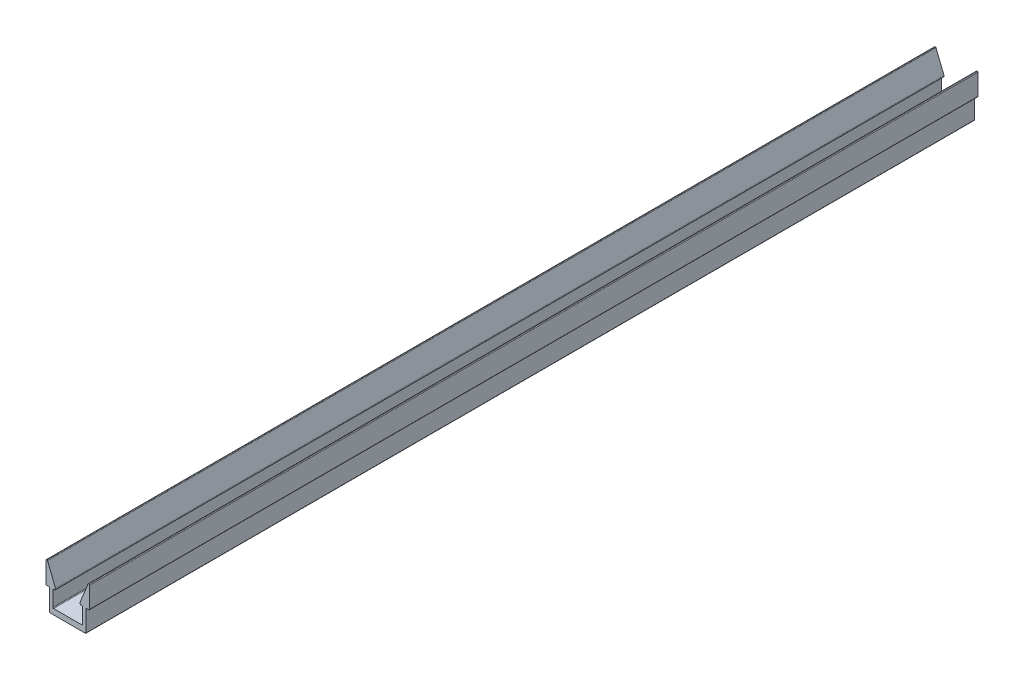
ISO-10303-21;
HEADER;
FILE_DESCRIPTION(('STEP AP214'),'2;1');
FILE_NAME('part.step','',(''),(''),'','','');
FILE_SCHEMA(('AUTOMOTIVE_DESIGN { 1 0 10303 214 1 1 1 1 }'));
ENDSEC;
DATA;
#1=APPLICATION_CONTEXT('core data for automotive mechanical design processes');
#2=APPLICATION_PROTOCOL_DEFINITION('international standard','automotive_design',2000,#1);
#3=PRODUCT_CONTEXT('',#1,'mechanical');
#4=PRODUCT('Part','Part','',(#3));
#5=PRODUCT_RELATED_PRODUCT_CATEGORY('part','',(#4));
#6=PRODUCT_DEFINITION_FORMATION('','',#4);
#7=PRODUCT_DEFINITION_CONTEXT('part definition',#1,'design');
#8=PRODUCT_DEFINITION('design','',#6,#7);
#9=PRODUCT_DEFINITION_SHAPE('','',#8);
#10=(LENGTH_UNIT() NAMED_UNIT(*) SI_UNIT(.MILLI.,.METRE.));
#11=(NAMED_UNIT(*) PLANE_ANGLE_UNIT() SI_UNIT($,.RADIAN.));
#12=(NAMED_UNIT(*) SI_UNIT($,.STERADIAN.) SOLID_ANGLE_UNIT());
#13=UNCERTAINTY_MEASURE_WITH_UNIT(LENGTH_MEASURE(1.E-05),#10,'distance_accuracy_value','');
#14=(GEOMETRIC_REPRESENTATION_CONTEXT(3) GLOBAL_UNCERTAINTY_ASSIGNED_CONTEXT((#13)) GLOBAL_UNIT_ASSIGNED_CONTEXT((#10,
#11,#12)) REPRESENTATION_CONTEXT('',''));
#15=CARTESIAN_POINT('',(0.,0.,0.));
#16=DIRECTION('',(0.,0.,1.));
#17=DIRECTION('',(1.,0.,0.));
#18=AXIS2_PLACEMENT_3D('',#15,#16,#17);
#19=CARTESIAN_POINT('',(8.128,3.175,31.75));
#20=DIRECTION('',(0.,-1.,0.));
#21=DIRECTION('',(0.,0.,-1.));
#22=AXIS2_PLACEMENT_3D('',#19,#20,#21);
#23=PLANE('',#22);
#24=DIRECTION('',(-1.,0.,0.));
#25=VECTOR('',#24,1.);
#26=CARTESIAN_POINT('',(8.128,3.175,0.));
#27=LINE('',#26,#25);
#28=CARTESIAN_POINT('',(8.128,3.175,0.));
#29=VERTEX_POINT('',#28);
#30=CARTESIAN_POINT('',(-8.128,3.175,0.));
#31=VERTEX_POINT('',#30);
#32=EDGE_CURVE('E317',#29,#31,#27,.T.);
#33=ORIENTED_EDGE('',*,*,#32,.T.);
#34=DIRECTION('',(0.,0.,-1.));
#35=VECTOR('',#34,1.);
#36=CARTESIAN_POINT('',(-8.128,3.175,31.75));
#37=LINE('',#36,#35);
#38=CARTESIAN_POINT('',(-8.128,3.175,508.));
#39=VERTEX_POINT('',#38);
#40=EDGE_CURVE('E449',#39,#31,#37,.T.);
#41=ORIENTED_EDGE('',*,*,#40,.F.);
#42=DIRECTION('',(1.,0.,0.));
#43=VECTOR('',#42,1.);
#44=CARTESIAN_POINT('',(-8.128,3.175,508.));
#45=LINE('',#44,#43);
#46=CARTESIAN_POINT('',(8.128,3.175,508.));
#47=VERTEX_POINT('',#46);
#48=EDGE_CURVE('E312',#39,#47,#45,.T.);
#49=ORIENTED_EDGE('',*,*,#48,.T.);
#50=DIRECTION('',(0.,0.,-1.));
#51=VECTOR('',#50,1.);
#52=CARTESIAN_POINT('',(8.128,3.175,31.75));
#53=LINE('',#52,#51);
#54=EDGE_CURVE('E22',#47,#29,#53,.T.);
#55=ORIENTED_EDGE('',*,*,#54,.T.);
#56=EDGE_LOOP('',(#33,#41,#49,#55));
#57=FACE_BOUND('',#56,.T.);
#58=ADVANCED_FACE('F14',(#57),#23,.F.);
#59=CARTESIAN_POINT('',(-10.033,0.,31.75));
#60=DIRECTION('',(0.,1.,0.));
#61=DIRECTION('',(0.,0.,1.));
#62=AXIS2_PLACEMENT_3D('',#59,#60,#61);
#63=PLANE('',#62);
#64=DIRECTION('',(1.,0.,0.));
#65=VECTOR('',#64,1.);
#66=CARTESIAN_POINT('',(-10.033,0.,0.));
#67=LINE('',#66,#65);
#68=CARTESIAN_POINT('',(-10.033,0.,0.));
#69=VERTEX_POINT('',#68);
#70=CARTESIAN_POINT('',(10.033,0.,0.));
#71=VERTEX_POINT('',#70);
#72=EDGE_CURVE('E347',#69,#71,#67,.T.);
#73=ORIENTED_EDGE('',*,*,#72,.T.);
#74=DIRECTION('',(0.,0.,-1.));
#75=VECTOR('',#74,1.);
#76=CARTESIAN_POINT('',(10.033,0.,31.75));
#77=LINE('',#76,#75);
#78=CARTESIAN_POINT('',(10.033,0.,508.));
#79=VERTEX_POINT('',#78);
#80=EDGE_CURVE('E404',#79,#71,#77,.T.);
#81=ORIENTED_EDGE('',*,*,#80,.F.);
#82=DIRECTION('',(-1.,0.,0.));
#83=VECTOR('',#82,1.);
#84=CARTESIAN_POINT('',(10.033,0.,508.));
#85=LINE('',#84,#83);
#86=CARTESIAN_POINT('',(-10.033,0.,508.));
#87=VERTEX_POINT('',#86);
#88=EDGE_CURVE('E267',#79,#87,#85,.T.);
#89=ORIENTED_EDGE('',*,*,#88,.T.);
#90=DIRECTION('',(0.,0.,-1.));
#91=VECTOR('',#90,1.);
#92=CARTESIAN_POINT('',(-10.033,0.,31.75));
#93=LINE('',#92,#91);
#94=EDGE_CURVE('E407',#87,#69,#93,.T.);
#95=ORIENTED_EDGE('',*,*,#94,.T.);
#96=EDGE_LOOP('',(#73,#81,#89,#95));
#97=FACE_BOUND('',#96,.T.);
#98=ADVANCED_FACE('F515',(#97),#63,.F.);
#99=CARTESIAN_POINT('',(8.509,12.7,31.75));
#100=DIRECTION('',(1.,0.,0.));
#101=DIRECTION('',(0.,1.,0.));
#102=AXIS2_PLACEMENT_3D('',#99,#100,#101);
#103=PLANE('',#102);
#104=DIRECTION('',(0.,-1.,0.));
#105=VECTOR('',#104,1.);
#106=CARTESIAN_POINT('',(8.509,12.7,0.));
#107=LINE('',#106,#105);
#108=CARTESIAN_POINT('',(8.509,12.7,0.));
#109=VERTEX_POINT('',#108);
#110=CARTESIAN_POINT('',(8.509,3.556,0.));
#111=VERTEX_POINT('',#110);
#112=EDGE_CURVE('E215',#109,#111,#107,.T.);
#113=ORIENTED_EDGE('',*,*,#112,.T.);
#114=DIRECTION('',(0.,0.,-1.));
#115=VECTOR('',#114,1.);
#116=CARTESIAN_POINT('',(8.509,3.556,31.75));
#117=LINE('',#116,#115);
#118=CARTESIAN_POINT('',(8.509,3.556,508.));
#119=VERTEX_POINT('',#118);
#120=EDGE_CURVE('E9',#119,#111,#117,.T.);
#121=ORIENTED_EDGE('',*,*,#120,.F.);
#122=DIRECTION('',(0.,1.,0.));
#123=VECTOR('',#122,1.);
#124=CARTESIAN_POINT('',(8.509,3.556,508.));
#125=LINE('',#124,#123);
#126=CARTESIAN_POINT('',(8.509,12.7,508.));
#127=VERTEX_POINT('',#126);
#128=EDGE_CURVE('E213',#119,#127,#125,.T.);
#129=ORIENTED_EDGE('',*,*,#128,.T.);
#130=DIRECTION('',(0.,0.,-1.));
#131=VECTOR('',#130,1.);
#132=CARTESIAN_POINT('',(8.509,12.7,31.75));
#133=LINE('',#132,#131);
#134=EDGE_CURVE('E371',#127,#109,#133,.T.);
#135=ORIENTED_EDGE('',*,*,#134,.T.);
#136=EDGE_LOOP('',(#113,#121,#129,#135));
#137=FACE_BOUND('',#136,.T.);
#138=ADVANCED_FACE('F16',(#137),#103,.F.);
#139=CARTESIAN_POINT('',(8.128,3.556,31.75));
#140=DIRECTION('',(0.,0.,-1.));
#141=DIRECTION('',(-1.,0.,0.));
#142=AXIS2_PLACEMENT_3D('',#139,#140,#141);
#143=CYLINDRICAL_SURFACE('',#142,0.381);
#144=CARTESIAN_POINT('',(8.128,3.556,0.));
#145=DIRECTION('',(0.,0.,-1.));
#146=DIRECTION('',(-1.,0.,0.));
#147=AXIS2_PLACEMENT_3D('',#144,#145,#146);
#148=CIRCLE('',#147,0.381);
#149=EDGE_CURVE('E315',#111,#29,#148,.T.);
#150=ORIENTED_EDGE('',*,*,#149,.T.);
#151=ORIENTED_EDGE('',*,*,#54,.F.);
#152=CARTESIAN_POINT('',(8.128,3.556,508.));
#153=DIRECTION('',(0.,0.,1.));
#154=DIRECTION('',(0.,1.,0.));
#155=AXIS2_PLACEMENT_3D('',#152,#153,#154);
#156=CIRCLE('',#155,0.381);
#157=EDGE_CURVE('E223',#47,#119,#156,.T.);
#158=ORIENTED_EDGE('',*,*,#157,.T.);
#159=ORIENTED_EDGE('',*,*,#120,.T.);
#160=EDGE_LOOP('',(#150,#151,#158,#159));
#161=FACE_BOUND('',#160,.T.);
#162=ADVANCED_FACE('F229',(#161),#143,.F.);
#163=CARTESIAN_POINT('',(-8.128,3.556,31.75));
#164=DIRECTION('',(0.,0.,-1.));
#165=DIRECTION('',(-1.,0.,0.));
#166=AXIS2_PLACEMENT_3D('',#163,#164,#165);
#167=CYLINDRICAL_SURFACE('',#166,0.381);
#168=CARTESIAN_POINT('',(-8.128,3.556,0.));
#169=DIRECTION('',(0.,0.,-1.));
#170=DIRECTION('',(1.,0.,0.));
#171=AXIS2_PLACEMENT_3D('',#168,#169,#170);
#172=CIRCLE('',#171,0.381);
#173=CARTESIAN_POINT('',(-8.509,3.556,0.));
#174=VERTEX_POINT('',#173);
#175=EDGE_CURVE('E319',#31,#174,#172,.T.);
#176=ORIENTED_EDGE('',*,*,#175,.T.);
#177=DIRECTION('',(0.,0.,-1.));
#178=VECTOR('',#177,1.);
#179=CARTESIAN_POINT('',(-8.509,3.556,31.75));
#180=LINE('',#179,#178);
#181=CARTESIAN_POINT('',(-8.509,3.556,508.));
#182=VERTEX_POINT('',#181);
#183=EDGE_CURVE('E446',#182,#174,#180,.T.);
#184=ORIENTED_EDGE('',*,*,#183,.F.);
#185=CARTESIAN_POINT('',(-8.128,3.556,508.));
#186=DIRECTION('',(0.,0.,1.));
#187=DIRECTION('',(0.,1.,0.));
#188=AXIS2_PLACEMENT_3D('',#185,#186,#187);
#189=CIRCLE('',#188,0.381);
#190=EDGE_CURVE('E309',#182,#39,#189,.T.);
#191=ORIENTED_EDGE('',*,*,#190,.T.);
#192=ORIENTED_EDGE('',*,*,#40,.T.);
#193=EDGE_LOOP('',(#176,#184,#191,#192));
#194=FACE_BOUND('',#193,.T.);
#195=ADVANCED_FACE('F459',(#194),#167,.F.);
#196=CARTESIAN_POINT('',(-8.509,12.7,31.75));
#197=DIRECTION('',(-1.,0.,0.));
#198=DIRECTION('',(0.,-1.,0.));
#199=AXIS2_PLACEMENT_3D('',#196,#197,#198);
#200=PLANE('',#199);
#201=DIRECTION('',(0.,1.,0.));
#202=VECTOR('',#201,1.);
#203=CARTESIAN_POINT('',(-8.509,12.7,0.));
#204=LINE('',#203,#202);
#205=CARTESIAN_POINT('',(-8.509,12.7,0.));
#206=VERTEX_POINT('',#205);
#207=EDGE_CURVE('E321',#174,#206,#204,.T.);
#208=ORIENTED_EDGE('',*,*,#207,.T.);
#209=DIRECTION('',(0.,0.,-1.));
#210=VECTOR('',#209,1.);
#211=CARTESIAN_POINT('',(-8.509,12.7,31.75));
#212=LINE('',#211,#210);
#213=CARTESIAN_POINT('',(-8.509,12.7,508.));
#214=VERTEX_POINT('',#213);
#215=EDGE_CURVE('E443',#214,#206,#212,.T.);
#216=ORIENTED_EDGE('',*,*,#215,.F.);
#217=DIRECTION('',(0.,-1.,0.));
#218=VECTOR('',#217,1.);
#219=CARTESIAN_POINT('',(-8.509,12.7,508.));
#220=LINE('',#219,#218);
#221=EDGE_CURVE('E306',#214,#182,#220,.T.);
#222=ORIENTED_EDGE('',*,*,#221,.T.);
#223=ORIENTED_EDGE('',*,*,#183,.T.);
#224=EDGE_LOOP('',(#208,#216,#222,#223));
#225=FACE_BOUND('',#224,.T.);
#226=ADVANCED_FACE('F462',(#225),#200,.F.);
#227=CARTESIAN_POINT('',(-7.68257838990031,12.7,31.75));
#228=DIRECTION('',(0.,1.,0.));
#229=DIRECTION('',(0.,0.,1.));
#230=AXIS2_PLACEMENT_3D('',#227,#228,#229);
#231=PLANE('',#230);
#232=DIRECTION('',(1.,0.,0.));
#233=VECTOR('',#232,1.);
#234=CARTESIAN_POINT('',(-7.68257838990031,12.7,0.));
#235=LINE('',#234,#233);
#236=CARTESIAN_POINT('',(-7.68257838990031,12.7,0.));
#237=VERTEX_POINT('',#236);
#238=EDGE_CURVE('E323',#206,#237,#235,.T.);
#239=ORIENTED_EDGE('',*,*,#238,.T.);
#240=DIRECTION('',(0.,0.,-1.));
#241=VECTOR('',#240,1.);
#242=CARTESIAN_POINT('',(-7.68257838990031,12.7,31.75));
#243=LINE('',#242,#241);
#244=CARTESIAN_POINT('',(-7.68257838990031,12.7,508.));
#245=VERTEX_POINT('',#244);
#246=EDGE_CURVE('E440',#245,#237,#243,.T.);
#247=ORIENTED_EDGE('',*,*,#246,.F.);
#248=DIRECTION('',(-1.,0.,0.));
#249=VECTOR('',#248,1.);
#250=CARTESIAN_POINT('',(-7.68257838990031,12.7,508.));
#251=LINE('',#250,#249);
#252=EDGE_CURVE('E303',#245,#214,#251,.T.);
#253=ORIENTED_EDGE('',*,*,#252,.T.);
#254=ORIENTED_EDGE('',*,*,#215,.T.);
#255=EDGE_LOOP('',(#239,#247,#253,#254));
#256=FACE_BOUND('',#255,.T.);
#257=ADVANCED_FACE('F467',(#256),#231,.F.);
#258=CARTESIAN_POINT('',(-7.68257838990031,13.462,31.75));
#259=DIRECTION('',(0.,0.,-1.));
#260=DIRECTION('',(-1.,0.,0.));
#261=AXIS2_PLACEMENT_3D('',#258,#259,#260);
#262=CYLINDRICAL_SURFACE('',#261,0.762);
#263=CARTESIAN_POINT('',(-7.68257838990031,13.462,0.));
#264=DIRECTION('',(0.,0.,1.));
#265=DIRECTION('',(-1.,0.,0.));
#266=AXIS2_PLACEMENT_3D('',#263,#264,#265);
#267=CIRCLE('',#266,0.762);
#268=CARTESIAN_POINT('',(-6.97606429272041,13.7474502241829,0.));
#269=VERTEX_POINT('',#268);
#270=EDGE_CURVE('E325',#237,#269,#267,.T.);
#271=ORIENTED_EDGE('',*,*,#270,.T.);
#272=DIRECTION('',(0.,0.,-1.));
#273=VECTOR('',#272,1.);
#274=CARTESIAN_POINT('',(-6.97606429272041,13.7474502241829,31.75));
#275=LINE('',#274,#273);
#276=CARTESIAN_POINT('',(-6.97606429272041,13.7474502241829,508.));
#277=VERTEX_POINT('',#276);
#278=EDGE_CURVE('E437',#277,#269,#275,.T.);
#279=ORIENTED_EDGE('',*,*,#278,.F.);
#280=CARTESIAN_POINT('',(-7.68257838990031,13.462,508.));
#281=DIRECTION('',(0.,0.,-1.));
#282=DIRECTION('',(0.,1.,0.));
#283=AXIS2_PLACEMENT_3D('',#280,#281,#282);
#284=CIRCLE('',#283,0.762);
#285=EDGE_CURVE('E300',#277,#245,#284,.T.);
#286=ORIENTED_EDGE('',*,*,#285,.T.);
#287=ORIENTED_EDGE('',*,*,#246,.T.);
#288=EDGE_LOOP('',(#271,#279,#286,#287));
#289=FACE_BOUND('',#288,.T.);
#290=ADVANCED_FACE('F470',(#289),#262,.T.);
#291=CARTESIAN_POINT('',(-11.587730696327,25.1617251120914,31.75));
#292=DIRECTION('',(-0.92718385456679,-0.374606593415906,0.));
#293=DIRECTION('',(0.374606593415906,-0.92718385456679,0.));
#294=AXIS2_PLACEMENT_3D('',#291,#292,#293);
#295=PLANE('',#294);
#296=DIRECTION('',(-0.374606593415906,0.92718385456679,0.));
#297=VECTOR('',#296,1.);
#298=CARTESIAN_POINT('',(-11.587730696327,25.1617251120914,0.));
#299=LINE('',#298,#297);
#300=CARTESIAN_POINT('',(-11.587730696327,25.1617251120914,0.));
#301=VERTEX_POINT('',#300);
#302=EDGE_CURVE('E327',#269,#301,#299,.T.);
#303=ORIENTED_EDGE('',*,*,#302,.T.);
#304=DIRECTION('',(0.,0.,-1.));
#305=VECTOR('',#304,1.);
#306=CARTESIAN_POINT('',(-11.587730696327,25.1617251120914,31.75));
#307=LINE('',#306,#305);
#308=CARTESIAN_POINT('',(-11.587730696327,25.1617251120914,508.));
#309=VERTEX_POINT('',#308);
#310=EDGE_CURVE('E434',#309,#301,#307,.T.);
#311=ORIENTED_EDGE('',*,*,#310,.F.);
#312=DIRECTION('',(0.374606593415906,-0.92718385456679,0.));
#313=VECTOR('',#312,1.);
#314=CARTESIAN_POINT('',(-11.587730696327,25.1617251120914,508.));
#315=LINE('',#314,#313);
#316=EDGE_CURVE('E297',#309,#277,#315,.T.);
#317=ORIENTED_EDGE('',*,*,#316,.T.);
#318=ORIENTED_EDGE('',*,*,#278,.T.);
#319=EDGE_LOOP('',(#303,#311,#317,#318));
#320=FACE_BOUND('',#319,.T.);
#321=ADVANCED_FACE('F475',(#320),#295,.F.);
#322=CARTESIAN_POINT('',(-11.940987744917,25.019,31.75));
#323=DIRECTION('',(0.,0.,-1.));
#324=DIRECTION('',(-1.,0.,0.));
#325=AXIS2_PLACEMENT_3D('',#322,#323,#324);
#326=CYLINDRICAL_SURFACE('',#325,0.381);
#327=CARTESIAN_POINT('',(-11.940987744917,25.019,0.));
#328=DIRECTION('',(0.,0.,1.));
#329=DIRECTION('',(-1.,0.,0.));
#330=AXIS2_PLACEMENT_3D('',#327,#328,#329);
#331=CIRCLE('',#330,0.381);
#332=CARTESIAN_POINT('',(-11.940987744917,25.4,0.));
#333=VERTEX_POINT('',#332);
#334=EDGE_CURVE('E329',#301,#333,#331,.T.);
#335=ORIENTED_EDGE('',*,*,#334,.T.);
#336=DIRECTION('',(0.,0.,-1.));
#337=VECTOR('',#336,1.);
#338=CARTESIAN_POINT('',(-11.940987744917,25.4,31.75));
#339=LINE('',#338,#337);
#340=CARTESIAN_POINT('',(-11.940987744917,25.4,508.));
#341=VERTEX_POINT('',#340);
#342=EDGE_CURVE('E431',#341,#333,#339,.T.);
#343=ORIENTED_EDGE('',*,*,#342,.F.);
#344=CARTESIAN_POINT('',(-11.940987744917,25.019,508.));
#345=DIRECTION('',(0.,0.,-1.));
#346=DIRECTION('',(0.,1.,0.));
#347=AXIS2_PLACEMENT_3D('',#344,#345,#346);
#348=CIRCLE('',#347,0.381);
#349=EDGE_CURVE('E294',#341,#309,#348,.T.);
#350=ORIENTED_EDGE('',*,*,#349,.T.);
#351=ORIENTED_EDGE('',*,*,#310,.T.);
#352=EDGE_LOOP('',(#335,#343,#350,#351));
#353=FACE_BOUND('',#352,.T.);
#354=ADVANCED_FACE('F478',(#353),#326,.T.);
#355=CARTESIAN_POINT('',(-12.065,25.4,31.75));
#356=DIRECTION('',(0.,-1.,0.));
#357=DIRECTION('',(1.,0.,0.));
#358=AXIS2_PLACEMENT_3D('',#355,#356,#357);
#359=PLANE('',#358);
#360=DIRECTION('',(-1.,0.,0.));
#361=VECTOR('',#360,1.);
#362=CARTESIAN_POINT('',(-12.065,25.4,0.));
#363=LINE('',#362,#361);
#364=CARTESIAN_POINT('',(-12.065,25.4,0.));
#365=VERTEX_POINT('',#364);
#366=EDGE_CURVE('E331',#333,#365,#363,.T.);
#367=ORIENTED_EDGE('',*,*,#366,.T.);
#368=DIRECTION('',(0.,0.,-1.));
#369=VECTOR('',#368,1.);
#370=CARTESIAN_POINT('',(-12.065,25.4,31.75));
#371=LINE('',#370,#369);
#372=CARTESIAN_POINT('',(-12.065,25.4,508.));
#373=VERTEX_POINT('',#372);
#374=EDGE_CURVE('E428',#373,#365,#371,.T.);
#375=ORIENTED_EDGE('',*,*,#374,.F.);
#376=DIRECTION('',(1.,0.,0.));
#377=VECTOR('',#376,1.);
#378=CARTESIAN_POINT('',(-12.065,25.4,508.));
#379=LINE('',#378,#377);
#380=EDGE_CURVE('E291',#373,#341,#379,.T.);
#381=ORIENTED_EDGE('',*,*,#380,.T.);
#382=ORIENTED_EDGE('',*,*,#342,.T.);
#383=EDGE_LOOP('',(#367,#375,#381,#382));
#384=FACE_BOUND('',#383,.T.);
#385=ADVANCED_FACE('F483',(#384),#359,.F.);
#386=CARTESIAN_POINT('',(-12.065,25.019,31.75));
#387=DIRECTION('',(0.,0.,-1.));
#388=DIRECTION('',(-1.,0.,0.));
#389=AXIS2_PLACEMENT_3D('',#386,#387,#388);
#390=CYLINDRICAL_SURFACE('',#389,0.381);
#391=CARTESIAN_POINT('',(-12.065,25.019,0.));
#392=DIRECTION('',(0.,0.,1.));
#393=DIRECTION('',(-1.,0.,0.));
#394=AXIS2_PLACEMENT_3D('',#391,#392,#393);
#395=CIRCLE('',#394,0.381);
#396=CARTESIAN_POINT('',(-12.446,25.019,0.));
#397=VERTEX_POINT('',#396);
#398=EDGE_CURVE('E333',#365,#397,#395,.T.);
#399=ORIENTED_EDGE('',*,*,#398,.T.);
#400=DIRECTION('',(0.,0.,-1.));
#401=VECTOR('',#400,1.);
#402=CARTESIAN_POINT('',(-12.446,25.019,31.75));
#403=LINE('',#402,#401);
#404=CARTESIAN_POINT('',(-12.446,25.019,508.));
#405=VERTEX_POINT('',#404);
#406=EDGE_CURVE('E425',#405,#397,#403,.T.);
#407=ORIENTED_EDGE('',*,*,#406,.F.);
#408=CARTESIAN_POINT('',(-12.065,25.019,508.));
#409=DIRECTION('',(0.,0.,-1.));
#410=DIRECTION('',(0.,1.,0.));
#411=AXIS2_PLACEMENT_3D('',#408,#409,#410);
#412=CIRCLE('',#411,0.381);
#413=EDGE_CURVE('E288',#405,#373,#412,.T.);
#414=ORIENTED_EDGE('',*,*,#413,.T.);
#415=ORIENTED_EDGE('',*,*,#374,.T.);
#416=EDGE_LOOP('',(#399,#407,#414,#415));
#417=FACE_BOUND('',#416,.T.);
#418=ADVANCED_FACE('F486',(#417),#390,.T.);
#419=CARTESIAN_POINT('',(-12.446,13.081,31.75));
#420=DIRECTION('',(1.,0.,0.));
#421=DIRECTION('',(0.,1.,0.));
#422=AXIS2_PLACEMENT_3D('',#419,#420,#421);
#423=PLANE('',#422);
#424=DIRECTION('',(0.,-1.,0.));
#425=VECTOR('',#424,1.);
#426=CARTESIAN_POINT('',(-12.446,13.081,0.));
#427=LINE('',#426,#425);
#428=CARTESIAN_POINT('',(-12.446,13.081,0.));
#429=VERTEX_POINT('',#428);
#430=EDGE_CURVE('E335',#397,#429,#427,.T.);
#431=ORIENTED_EDGE('',*,*,#430,.T.);
#432=DIRECTION('',(0.,0.,-1.));
#433=VECTOR('',#432,1.);
#434=CARTESIAN_POINT('',(-12.446,13.081,31.75));
#435=LINE('',#434,#433);
#436=CARTESIAN_POINT('',(-12.446,13.081,508.));
#437=VERTEX_POINT('',#436);
#438=EDGE_CURVE('E422',#437,#429,#435,.T.);
#439=ORIENTED_EDGE('',*,*,#438,.F.);
#440=DIRECTION('',(0.,1.,0.));
#441=VECTOR('',#440,1.);
#442=CARTESIAN_POINT('',(-12.446,13.081,508.));
#443=LINE('',#442,#441);
#444=EDGE_CURVE('E285',#437,#405,#443,.T.);
#445=ORIENTED_EDGE('',*,*,#444,.T.);
#446=ORIENTED_EDGE('',*,*,#406,.T.);
#447=EDGE_LOOP('',(#431,#439,#445,#446));
#448=FACE_BOUND('',#447,.T.);
#449=ADVANCED_FACE('F491',(#448),#423,.F.);
#450=CARTESIAN_POINT('',(-12.065,13.081,31.75));
#451=DIRECTION('',(0.,0.,-1.));
#452=DIRECTION('',(-1.,0.,0.));
#453=AXIS2_PLACEMENT_3D('',#450,#451,#452);
#454=CYLINDRICAL_SURFACE('',#453,0.381);
#455=CARTESIAN_POINT('',(-12.065,13.081,0.));
#456=DIRECTION('',(0.,0.,1.));
#457=DIRECTION('',(-1.,0.,0.));
#458=AXIS2_PLACEMENT_3D('',#455,#456,#457);
#459=CIRCLE('',#458,0.381);
#460=CARTESIAN_POINT('',(-12.065,12.7,0.));
#461=VERTEX_POINT('',#460);
#462=EDGE_CURVE('E337',#429,#461,#459,.T.);
#463=ORIENTED_EDGE('',*,*,#462,.T.);
#464=DIRECTION('',(0.,0.,-1.));
#465=VECTOR('',#464,1.);
#466=CARTESIAN_POINT('',(-12.065,12.7,31.75));
#467=LINE('',#466,#465);
#468=CARTESIAN_POINT('',(-12.065,12.7,508.));
#469=VERTEX_POINT('',#468);
#470=EDGE_CURVE('E419',#469,#461,#467,.T.);
#471=ORIENTED_EDGE('',*,*,#470,.F.);
#472=CARTESIAN_POINT('',(-12.065,13.081,508.));
#473=DIRECTION('',(0.,0.,-1.));
#474=DIRECTION('',(0.,1.,0.));
#475=AXIS2_PLACEMENT_3D('',#472,#473,#474);
#476=CIRCLE('',#475,0.381);
#477=EDGE_CURVE('E282',#469,#437,#476,.T.);
#478=ORIENTED_EDGE('',*,*,#477,.T.);
#479=ORIENTED_EDGE('',*,*,#438,.T.);
#480=EDGE_LOOP('',(#463,#471,#478,#479));
#481=FACE_BOUND('',#480,.T.);
#482=ADVANCED_FACE('F494',(#481),#454,.T.);
#483=CARTESIAN_POINT('',(-10.795,12.7,31.75));
#484=DIRECTION('',(0.,1.,0.));
#485=DIRECTION('',(0.,0.,1.));
#486=AXIS2_PLACEMENT_3D('',#483,#484,#485);
#487=PLANE('',#486);
#488=DIRECTION('',(1.,0.,0.));
#489=VECTOR('',#488,1.);
#490=CARTESIAN_POINT('',(-10.795,12.7,0.));
#491=LINE('',#490,#489);
#492=CARTESIAN_POINT('',(-10.795,12.7,0.));
#493=VERTEX_POINT('',#492);
#494=EDGE_CURVE('E339',#461,#493,#491,.T.);
#495=ORIENTED_EDGE('',*,*,#494,.T.);
#496=DIRECTION('',(0.,0.,-1.));
#497=VECTOR('',#496,1.);
#498=CARTESIAN_POINT('',(-10.795,12.7,31.75));
#499=LINE('',#498,#497);
#500=CARTESIAN_POINT('',(-10.795,12.7,508.));
#501=VERTEX_POINT('',#500);
#502=EDGE_CURVE('E416',#501,#493,#499,.T.);
#503=ORIENTED_EDGE('',*,*,#502,.F.);
#504=DIRECTION('',(-1.,0.,0.));
#505=VECTOR('',#504,1.);
#506=CARTESIAN_POINT('',(-10.795,12.7,508.));
#507=LINE('',#506,#505);
#508=EDGE_CURVE('E279',#501,#469,#507,.T.);
#509=ORIENTED_EDGE('',*,*,#508,.T.);
#510=ORIENTED_EDGE('',*,*,#470,.T.);
#511=EDGE_LOOP('',(#495,#503,#509,#510));
#512=FACE_BOUND('',#511,.T.);
#513=ADVANCED_FACE('F499',(#512),#487,.F.);
#514=CARTESIAN_POINT('',(-10.795,12.319,31.75));
#515=DIRECTION('',(0.,0.,-1.));
#516=DIRECTION('',(-1.,0.,0.));
#517=AXIS2_PLACEMENT_3D('',#514,#515,#516);
#518=CYLINDRICAL_SURFACE('',#517,0.381);
#519=CARTESIAN_POINT('',(-10.795,12.319,0.));
#520=DIRECTION('',(0.,0.,-1.));
#521=DIRECTION('',(1.,0.,0.));
#522=AXIS2_PLACEMENT_3D('',#519,#520,#521);
#523=CIRCLE('',#522,0.381);
#524=CARTESIAN_POINT('',(-10.414,12.319,0.));
#525=VERTEX_POINT('',#524);
#526=EDGE_CURVE('E341',#493,#525,#523,.T.);
#527=ORIENTED_EDGE('',*,*,#526,.T.);
#528=DIRECTION('',(0.,0.,-1.));
#529=VECTOR('',#528,1.);
#530=CARTESIAN_POINT('',(-10.414,12.319,31.75));
#531=LINE('',#530,#529);
#532=CARTESIAN_POINT('',(-10.414,12.319,508.));
#533=VERTEX_POINT('',#532);
#534=EDGE_CURVE('E413',#533,#525,#531,.T.);
#535=ORIENTED_EDGE('',*,*,#534,.F.);
#536=CARTESIAN_POINT('',(-10.795,12.319,508.));
#537=DIRECTION('',(0.,0.,1.));
#538=DIRECTION('',(0.,1.,0.));
#539=AXIS2_PLACEMENT_3D('',#536,#537,#538);
#540=CIRCLE('',#539,0.381);
#541=EDGE_CURVE('E276',#533,#501,#540,.T.);
#542=ORIENTED_EDGE('',*,*,#541,.T.);
#543=ORIENTED_EDGE('',*,*,#502,.T.);
#544=EDGE_LOOP('',(#527,#535,#542,#543));
#545=FACE_BOUND('',#544,.T.);
#546=ADVANCED_FACE('F502',(#545),#518,.F.);
#547=CARTESIAN_POINT('',(-10.414,0.381,31.75));
#548=DIRECTION('',(1.,0.,0.));
#549=DIRECTION('',(0.,0.,-1.));
#550=AXIS2_PLACEMENT_3D('',#547,#548,#549);
#551=PLANE('',#550);
#552=DIRECTION('',(0.,-1.,0.));
#553=VECTOR('',#552,1.);
#554=CARTESIAN_POINT('',(-10.414,0.381,0.));
#555=LINE('',#554,#553);
#556=CARTESIAN_POINT('',(-10.414,0.381,0.));
#557=VERTEX_POINT('',#556);
#558=EDGE_CURVE('E343',#525,#557,#555,.T.);
#559=ORIENTED_EDGE('',*,*,#558,.T.);
#560=DIRECTION('',(0.,0.,-1.));
#561=VECTOR('',#560,1.);
#562=CARTESIAN_POINT('',(-10.414,0.381,31.75));
#563=LINE('',#562,#561);
#564=CARTESIAN_POINT('',(-10.414,0.381,508.));
#565=VERTEX_POINT('',#564);
#566=EDGE_CURVE('E410',#565,#557,#563,.T.);
#567=ORIENTED_EDGE('',*,*,#566,.F.);
#568=DIRECTION('',(0.,1.,0.));
#569=VECTOR('',#568,1.);
#570=CARTESIAN_POINT('',(-10.414,0.381,508.));
#571=LINE('',#570,#569);
#572=EDGE_CURVE('E273',#565,#533,#571,.T.);
#573=ORIENTED_EDGE('',*,*,#572,.T.);
#574=ORIENTED_EDGE('',*,*,#534,.T.);
#575=EDGE_LOOP('',(#559,#567,#573,#574));
#576=FACE_BOUND('',#575,.T.);
#577=ADVANCED_FACE('F507',(#576),#551,.F.);
#578=CARTESIAN_POINT('',(-10.033,0.381,31.75));
#579=DIRECTION('',(0.,0.,-1.));
#580=DIRECTION('',(-1.,0.,0.));
#581=AXIS2_PLACEMENT_3D('',#578,#579,#580);
#582=CYLINDRICAL_SURFACE('',#581,0.381);
#583=CARTESIAN_POINT('',(-10.033,0.381,0.));
#584=DIRECTION('',(0.,0.,1.));
#585=DIRECTION('',(-1.,0.,0.));
#586=AXIS2_PLACEMENT_3D('',#583,#584,#585);
#587=CIRCLE('',#586,0.381);
#588=EDGE_CURVE('E345',#557,#69,#587,.T.);
#589=ORIENTED_EDGE('',*,*,#588,.T.);
#590=ORIENTED_EDGE('',*,*,#94,.F.);
#591=CARTESIAN_POINT('',(-10.033,0.381,508.));
#592=DIRECTION('',(0.,0.,-1.));
#593=DIRECTION('',(0.,1.,0.));
#594=AXIS2_PLACEMENT_3D('',#591,#592,#593);
#595=CIRCLE('',#594,0.381);
#596=EDGE_CURVE('E270',#87,#565,#595,.T.);
#597=ORIENTED_EDGE('',*,*,#596,.T.);
#598=ORIENTED_EDGE('',*,*,#566,.T.);
#599=EDGE_LOOP('',(#589,#590,#597,#598));
#600=FACE_BOUND('',#599,.T.);
#601=ADVANCED_FACE('F510',(#600),#582,.T.);
#602=CARTESIAN_POINT('',(10.033,0.381,31.75));
#603=DIRECTION('',(0.,0.,-1.));
#604=DIRECTION('',(-1.,0.,0.));
#605=AXIS2_PLACEMENT_3D('',#602,#603,#604);
#606=CYLINDRICAL_SURFACE('',#605,0.381);
#607=CARTESIAN_POINT('',(10.033,0.381,0.));
#608=DIRECTION('',(0.,0.,1.));
#609=DIRECTION('',(1.,0.,0.));
#610=AXIS2_PLACEMENT_3D('',#607,#608,#609);
#611=CIRCLE('',#610,0.381);
#612=CARTESIAN_POINT('',(10.414,0.381,0.));
#613=VERTEX_POINT('',#612);
#614=EDGE_CURVE('E349',#71,#613,#611,.T.);
#615=ORIENTED_EDGE('',*,*,#614,.T.);
#616=DIRECTION('',(0.,0.,-1.));
#617=VECTOR('',#616,1.);
#618=CARTESIAN_POINT('',(10.414,0.381,31.75));
#619=LINE('',#618,#617);
#620=CARTESIAN_POINT('',(10.414,0.381,508.));
#621=VERTEX_POINT('',#620);
#622=EDGE_CURVE('E401',#621,#613,#619,.T.);
#623=ORIENTED_EDGE('',*,*,#622,.F.);
#624=CARTESIAN_POINT('',(10.033,0.381,508.));
#625=DIRECTION('',(0.,0.,-1.));
#626=DIRECTION('',(0.,1.,0.));
#627=AXIS2_PLACEMENT_3D('',#624,#625,#626);
#628=CIRCLE('',#627,0.381);
#629=EDGE_CURVE('E264',#621,#79,#628,.T.);
#630=ORIENTED_EDGE('',*,*,#629,.T.);
#631=ORIENTED_EDGE('',*,*,#80,.T.);
#632=EDGE_LOOP('',(#615,#623,#630,#631));
#633=FACE_BOUND('',#632,.T.);
#634=ADVANCED_FACE('F518',(#633),#606,.T.);
#635=CARTESIAN_POINT('',(10.414,0.381,31.75));
#636=DIRECTION('',(-1.,0.,0.));
#637=DIRECTION('',(0.,0.,1.));
#638=AXIS2_PLACEMENT_3D('',#635,#636,#637);
#639=PLANE('',#638);
#640=DIRECTION('',(0.,1.,0.));
#641=VECTOR('',#640,1.);
#642=CARTESIAN_POINT('',(10.414,0.381,0.));
#643=LINE('',#642,#641);
#644=CARTESIAN_POINT('',(10.414,12.319,0.));
#645=VERTEX_POINT('',#644);
#646=EDGE_CURVE('E351',#613,#645,#643,.T.);
#647=ORIENTED_EDGE('',*,*,#646,.T.);
#648=DIRECTION('',(0.,0.,-1.));
#649=VECTOR('',#648,1.);
#650=CARTESIAN_POINT('',(10.414,12.319,31.75));
#651=LINE('',#650,#649);
#652=CARTESIAN_POINT('',(10.414,12.319,508.));
#653=VERTEX_POINT('',#652);
#654=EDGE_CURVE('E398',#653,#645,#651,.T.);
#655=ORIENTED_EDGE('',*,*,#654,.F.);
#656=DIRECTION('',(0.,-1.,0.));
#657=VECTOR('',#656,1.);
#658=CARTESIAN_POINT('',(10.414,12.319,508.));
#659=LINE('',#658,#657);
#660=EDGE_CURVE('E261',#653,#621,#659,.T.);
#661=ORIENTED_EDGE('',*,*,#660,.T.);
#662=ORIENTED_EDGE('',*,*,#622,.T.);
#663=EDGE_LOOP('',(#647,#655,#661,#662));
#664=FACE_BOUND('',#663,.T.);
#665=ADVANCED_FACE('F523',(#664),#639,.F.);
#666=CARTESIAN_POINT('',(10.795,12.319,31.75));
#667=DIRECTION('',(0.,0.,-1.));
#668=DIRECTION('',(-1.,0.,0.));
#669=AXIS2_PLACEMENT_3D('',#666,#667,#668);
#670=CYLINDRICAL_SURFACE('',#669,0.381);
#671=CARTESIAN_POINT('',(10.795,12.319,0.));
#672=DIRECTION('',(0.,0.,-1.));
#673=DIRECTION('',(-1.,0.,0.));
#674=AXIS2_PLACEMENT_3D('',#671,#672,#673);
#675=CIRCLE('',#674,0.381);
#676=CARTESIAN_POINT('',(10.795,12.7,0.));
#677=VERTEX_POINT('',#676);
#678=EDGE_CURVE('E353',#645,#677,#675,.T.);
#679=ORIENTED_EDGE('',*,*,#678,.T.);
#680=DIRECTION('',(0.,0.,-1.));
#681=VECTOR('',#680,1.);
#682=CARTESIAN_POINT('',(10.795,12.7,31.75));
#683=LINE('',#682,#681);
#684=CARTESIAN_POINT('',(10.795,12.7,508.));
#685=VERTEX_POINT('',#684);
#686=EDGE_CURVE('E395',#685,#677,#683,.T.);
#687=ORIENTED_EDGE('',*,*,#686,.F.);
#688=CARTESIAN_POINT('',(10.795,12.319,508.));
#689=DIRECTION('',(0.,0.,1.));
#690=DIRECTION('',(0.,1.,0.));
#691=AXIS2_PLACEMENT_3D('',#688,#689,#690);
#692=CIRCLE('',#691,0.381);
#693=EDGE_CURVE('E258',#685,#653,#692,.T.);
#694=ORIENTED_EDGE('',*,*,#693,.T.);
#695=ORIENTED_EDGE('',*,*,#654,.T.);
#696=EDGE_LOOP('',(#679,#687,#694,#695));
#697=FACE_BOUND('',#696,.T.);
#698=ADVANCED_FACE('F526',(#697),#670,.F.);
#699=CARTESIAN_POINT('',(10.795,12.7,31.75));
#700=DIRECTION('',(0.,1.,0.));
#701=DIRECTION('',(0.,0.,1.));
#702=AXIS2_PLACEMENT_3D('',#699,#700,#701);
#703=PLANE('',#702);
#704=DIRECTION('',(1.,0.,0.));
#705=VECTOR('',#704,1.);
#706=CARTESIAN_POINT('',(10.795,12.7,0.));
#707=LINE('',#706,#705);
#708=CARTESIAN_POINT('',(12.065,12.7,0.));
#709=VERTEX_POINT('',#708);
#710=EDGE_CURVE('E355',#677,#709,#707,.T.);
#711=ORIENTED_EDGE('',*,*,#710,.T.);
#712=DIRECTION('',(0.,0.,-1.));
#713=VECTOR('',#712,1.);
#714=CARTESIAN_POINT('',(12.065,12.7,31.75));
#715=LINE('',#714,#713);
#716=CARTESIAN_POINT('',(12.065,12.7,508.));
#717=VERTEX_POINT('',#716);
#718=EDGE_CURVE('E392',#717,#709,#715,.T.);
#719=ORIENTED_EDGE('',*,*,#718,.F.);
#720=DIRECTION('',(-1.,0.,0.));
#721=VECTOR('',#720,1.);
#722=CARTESIAN_POINT('',(12.065,12.7,508.));
#723=LINE('',#722,#721);
#724=EDGE_CURVE('E255',#717,#685,#723,.T.);
#725=ORIENTED_EDGE('',*,*,#724,.T.);
#726=ORIENTED_EDGE('',*,*,#686,.T.);
#727=EDGE_LOOP('',(#711,#719,#725,#726));
#728=FACE_BOUND('',#727,.T.);
#729=ADVANCED_FACE('F531',(#728),#703,.F.);
#730=CARTESIAN_POINT('',(12.065,13.081,31.75));
#731=DIRECTION('',(0.,0.,-1.));
#732=DIRECTION('',(-1.,0.,0.));
#733=AXIS2_PLACEMENT_3D('',#730,#731,#732);
#734=CYLINDRICAL_SURFACE('',#733,0.381);
#735=CARTESIAN_POINT('',(12.065,13.081,0.));
#736=DIRECTION('',(0.,0.,1.));
#737=DIRECTION('',(1.,0.,0.));
#738=AXIS2_PLACEMENT_3D('',#735,#736,#737);
#739=CIRCLE('',#738,0.381);
#740=CARTESIAN_POINT('',(12.446,13.081,0.));
#741=VERTEX_POINT('',#740);
#742=EDGE_CURVE('E357',#709,#741,#739,.T.);
#743=ORIENTED_EDGE('',*,*,#742,.T.);
#744=DIRECTION('',(0.,0.,-1.));
#745=VECTOR('',#744,1.);
#746=CARTESIAN_POINT('',(12.446,13.081,31.75));
#747=LINE('',#746,#745);
#748=CARTESIAN_POINT('',(12.446,13.081,508.));
#749=VERTEX_POINT('',#748);
#750=EDGE_CURVE('E389',#749,#741,#747,.T.);
#751=ORIENTED_EDGE('',*,*,#750,.F.);
#752=CARTESIAN_POINT('',(12.065,13.081,508.));
#753=DIRECTION('',(0.,0.,-1.));
#754=DIRECTION('',(0.,1.,0.));
#755=AXIS2_PLACEMENT_3D('',#752,#753,#754);
#756=CIRCLE('',#755,0.381);
#757=EDGE_CURVE('E252',#749,#717,#756,.T.);
#758=ORIENTED_EDGE('',*,*,#757,.T.);
#759=ORIENTED_EDGE('',*,*,#718,.T.);
#760=EDGE_LOOP('',(#743,#751,#758,#759));
#761=FACE_BOUND('',#760,.T.);
#762=ADVANCED_FACE('F534',(#761),#734,.T.);
#763=CARTESIAN_POINT('',(12.446,13.081,31.75));
#764=DIRECTION('',(-1.,0.,0.));
#765=DIRECTION('',(0.,-1.,0.));
#766=AXIS2_PLACEMENT_3D('',#763,#764,#765);
#767=PLANE('',#766);
#768=DIRECTION('',(0.,1.,0.));
#769=VECTOR('',#768,1.);
#770=CARTESIAN_POINT('',(12.446,13.081,0.));
#771=LINE('',#770,#769);
#772=CARTESIAN_POINT('',(12.446,25.019,0.));
#773=VERTEX_POINT('',#772);
#774=EDGE_CURVE('E359',#741,#773,#771,.T.);
#775=ORIENTED_EDGE('',*,*,#774,.T.);
#776=DIRECTION('',(0.,0.,-1.));
#777=VECTOR('',#776,1.);
#778=CARTESIAN_POINT('',(12.446,25.019,31.75));
#779=LINE('',#778,#777);
#780=CARTESIAN_POINT('',(12.446,25.019,508.));
#781=VERTEX_POINT('',#780);
#782=EDGE_CURVE('E386',#781,#773,#779,.T.);
#783=ORIENTED_EDGE('',*,*,#782,.F.);
#784=DIRECTION('',(0.,-1.,0.));
#785=VECTOR('',#784,1.);
#786=CARTESIAN_POINT('',(12.446,25.019,508.));
#787=LINE('',#786,#785);
#788=EDGE_CURVE('E249',#781,#749,#787,.T.);
#789=ORIENTED_EDGE('',*,*,#788,.T.);
#790=ORIENTED_EDGE('',*,*,#750,.T.);
#791=EDGE_LOOP('',(#775,#783,#789,#790));
#792=FACE_BOUND('',#791,.T.);
#793=ADVANCED_FACE('F539',(#792),#767,.F.);
#794=CARTESIAN_POINT('',(12.065,25.019,31.75));
#795=DIRECTION('',(0.,0.,-1.));
#796=DIRECTION('',(-1.,0.,0.));
#797=AXIS2_PLACEMENT_3D('',#794,#795,#796);
#798=CYLINDRICAL_SURFACE('',#797,0.381);
#799=CARTESIAN_POINT('',(12.065,25.019,0.));
#800=DIRECTION('',(0.,0.,1.));
#801=DIRECTION('',(1.,0.,0.));
#802=AXIS2_PLACEMENT_3D('',#799,#800,#801);
#803=CIRCLE('',#802,0.381);
#804=CARTESIAN_POINT('',(12.065,25.4,0.));
#805=VERTEX_POINT('',#804);
#806=EDGE_CURVE('E361',#773,#805,#803,.T.);
#807=ORIENTED_EDGE('',*,*,#806,.T.);
#808=DIRECTION('',(0.,0.,-1.));
#809=VECTOR('',#808,1.);
#810=CARTESIAN_POINT('',(12.065,25.4,31.75));
#811=LINE('',#810,#809);
#812=CARTESIAN_POINT('',(12.065,25.4,508.));
#813=VERTEX_POINT('',#812);
#814=EDGE_CURVE('E383',#813,#805,#811,.T.);
#815=ORIENTED_EDGE('',*,*,#814,.F.);
#816=CARTESIAN_POINT('',(12.065,25.019,508.));
#817=DIRECTION('',(0.,0.,-1.));
#818=DIRECTION('',(0.,1.,0.));
#819=AXIS2_PLACEMENT_3D('',#816,#817,#818);
#820=CIRCLE('',#819,0.381);
#821=EDGE_CURVE('E246',#813,#781,#820,.T.);
#822=ORIENTED_EDGE('',*,*,#821,.T.);
#823=ORIENTED_EDGE('',*,*,#782,.T.);
#824=EDGE_LOOP('',(#807,#815,#822,#823));
#825=FACE_BOUND('',#824,.T.);
#826=ADVANCED_FACE('F542',(#825),#798,.T.);
#827=CARTESIAN_POINT('',(12.065,25.4,31.75));
#828=DIRECTION('',(0.,-1.,0.));
#829=DIRECTION('',(1.,0.,0.));
#830=AXIS2_PLACEMENT_3D('',#827,#828,#829);
#831=PLANE('',#830);
#832=DIRECTION('',(-1.,0.,0.));
#833=VECTOR('',#832,1.);
#834=CARTESIAN_POINT('',(12.065,25.4,0.));
#835=LINE('',#834,#833);
#836=CARTESIAN_POINT('',(11.940987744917,25.4,0.));
#837=VERTEX_POINT('',#836);
#838=EDGE_CURVE('E363',#805,#837,#835,.T.);
#839=ORIENTED_EDGE('',*,*,#838,.T.);
#840=DIRECTION('',(0.,0.,-1.));
#841=VECTOR('',#840,1.);
#842=CARTESIAN_POINT('',(11.940987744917,25.4,31.75));
#843=LINE('',#842,#841);
#844=CARTESIAN_POINT('',(11.940987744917,25.4,508.));
#845=VERTEX_POINT('',#844);
#846=EDGE_CURVE('E380',#845,#837,#843,.T.);
#847=ORIENTED_EDGE('',*,*,#846,.F.);
#848=DIRECTION('',(1.,0.,0.));
#849=VECTOR('',#848,1.);
#850=CARTESIAN_POINT('',(11.940987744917,25.4,508.));
#851=LINE('',#850,#849);
#852=EDGE_CURVE('E243',#845,#813,#851,.T.);
#853=ORIENTED_EDGE('',*,*,#852,.T.);
#854=ORIENTED_EDGE('',*,*,#814,.T.);
#855=EDGE_LOOP('',(#839,#847,#853,#854));
#856=FACE_BOUND('',#855,.T.);
#857=ADVANCED_FACE('F547',(#856),#831,.F.);
#858=CARTESIAN_POINT('',(11.940987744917,25.019,31.75));
#859=DIRECTION('',(0.,0.,-1.));
#860=DIRECTION('',(-1.,0.,0.));
#861=AXIS2_PLACEMENT_3D('',#858,#859,#860);
#862=CYLINDRICAL_SURFACE('',#861,0.381);
#863=CARTESIAN_POINT('',(11.940987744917,25.019,0.));
#864=DIRECTION('',(0.,0.,1.));
#865=DIRECTION('',(1.,0.,0.));
#866=AXIS2_PLACEMENT_3D('',#863,#864,#865);
#867=CIRCLE('',#866,0.381);
#868=CARTESIAN_POINT('',(11.587730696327,25.1617251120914,0.));
#869=VERTEX_POINT('',#868);
#870=EDGE_CURVE('E365',#837,#869,#867,.T.);
#871=ORIENTED_EDGE('',*,*,#870,.T.);
#872=DIRECTION('',(0.,0.,-1.));
#873=VECTOR('',#872,1.);
#874=CARTESIAN_POINT('',(11.587730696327,25.1617251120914,31.75));
#875=LINE('',#874,#873);
#876=CARTESIAN_POINT('',(11.587730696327,25.1617251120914,508.));
#877=VERTEX_POINT('',#876);
#878=EDGE_CURVE('E377',#877,#869,#875,.T.);
#879=ORIENTED_EDGE('',*,*,#878,.F.);
#880=CARTESIAN_POINT('',(11.940987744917,25.019,508.));
#881=DIRECTION('',(0.,0.,-1.));
#882=DIRECTION('',(0.,1.,0.));
#883=AXIS2_PLACEMENT_3D('',#880,#881,#882);
#884=CIRCLE('',#883,0.380999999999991);
#885=EDGE_CURVE('E240',#877,#845,#884,.T.);
#886=ORIENTED_EDGE('',*,*,#885,.T.);
#887=ORIENTED_EDGE('',*,*,#846,.T.);
#888=EDGE_LOOP('',(#871,#879,#886,#887));
#889=FACE_BOUND('',#888,.T.);
#890=ADVANCED_FACE('F550',(#889),#862,.T.);
#891=CARTESIAN_POINT('',(11.587730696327,25.1617251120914,31.75));
#892=DIRECTION('',(0.92718385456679,-0.374606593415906,0.));
#893=DIRECTION('',(0.374606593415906,0.92718385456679,0.));
#894=AXIS2_PLACEMENT_3D('',#891,#892,#893);
#895=PLANE('',#894);
#896=DIRECTION('',(-0.374606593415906,-0.92718385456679,0.));
#897=VECTOR('',#896,1.);
#898=CARTESIAN_POINT('',(11.587730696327,25.1617251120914,0.));
#899=LINE('',#898,#897);
#900=CARTESIAN_POINT('',(6.97606429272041,13.7474502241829,0.));
#901=VERTEX_POINT('',#900);
#902=EDGE_CURVE('E367',#869,#901,#899,.T.);
#903=ORIENTED_EDGE('',*,*,#902,.T.);
#904=DIRECTION('',(0.,0.,-1.));
#905=VECTOR('',#904,1.);
#906=CARTESIAN_POINT('',(6.97606429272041,13.7474502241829,31.75));
#907=LINE('',#906,#905);
#908=CARTESIAN_POINT('',(6.97606429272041,13.7474502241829,508.));
#909=VERTEX_POINT('',#908);
#910=EDGE_CURVE('E375',#909,#901,#907,.T.);
#911=ORIENTED_EDGE('',*,*,#910,.F.);
#912=DIRECTION('',(0.374606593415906,0.92718385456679,0.));
#913=VECTOR('',#912,1.);
#914=CARTESIAN_POINT('',(6.97606429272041,13.7474502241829,508.));
#915=LINE('',#914,#913);
#916=EDGE_CURVE('E237',#909,#877,#915,.T.);
#917=ORIENTED_EDGE('',*,*,#916,.T.);
#918=ORIENTED_EDGE('',*,*,#878,.T.);
#919=EDGE_LOOP('',(#903,#911,#917,#918));
#920=FACE_BOUND('',#919,.T.);
#921=ADVANCED_FACE('F553',(#920),#895,.F.);
#922=CARTESIAN_POINT('',(7.68257838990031,13.462,31.75));
#923=DIRECTION('',(0.,0.,-1.));
#924=DIRECTION('',(-1.,0.,0.));
#925=AXIS2_PLACEMENT_3D('',#922,#923,#924);
#926=CYLINDRICAL_SURFACE('',#925,0.762);
#927=CARTESIAN_POINT('',(7.68257838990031,13.462,0.));
#928=DIRECTION('',(0.,0.,1.));
#929=DIRECTION('',(1.,0.,0.));
#930=AXIS2_PLACEMENT_3D('',#927,#928,#929);
#931=CIRCLE('',#930,0.762);
#932=CARTESIAN_POINT('',(7.68257838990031,12.7,0.));
#933=VERTEX_POINT('',#932);
#934=EDGE_CURVE('E37',#901,#933,#931,.T.);
#935=ORIENTED_EDGE('',*,*,#934,.T.);
#936=DIRECTION('',(0.,0.,-1.));
#937=VECTOR('',#936,1.);
#938=CARTESIAN_POINT('',(7.68257838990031,12.7,31.75));
#939=LINE('',#938,#937);
#940=CARTESIAN_POINT('',(7.68257838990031,12.7,508.));
#941=VERTEX_POINT('',#940);
#942=EDGE_CURVE('E373',#941,#933,#939,.T.);
#943=ORIENTED_EDGE('',*,*,#942,.F.);
#944=CARTESIAN_POINT('',(7.68257838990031,13.462,508.));
#945=DIRECTION('',(0.,0.,-1.));
#946=DIRECTION('',(0.,1.,0.));
#947=AXIS2_PLACEMENT_3D('',#944,#945,#946);
#948=CIRCLE('',#947,0.762);
#949=EDGE_CURVE('E234',#941,#909,#948,.T.);
#950=ORIENTED_EDGE('',*,*,#949,.T.);
#951=ORIENTED_EDGE('',*,*,#910,.T.);
#952=EDGE_LOOP('',(#935,#943,#950,#951));
#953=FACE_BOUND('',#952,.T.);
#954=ADVANCED_FACE('F555',(#953),#926,.T.);
#955=CARTESIAN_POINT('',(7.68257838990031,12.7,31.75));
#956=DIRECTION('',(0.,1.,0.));
#957=DIRECTION('',(0.,0.,1.));
#958=AXIS2_PLACEMENT_3D('',#955,#956,#957);
#959=PLANE('',#958);
#960=DIRECTION('',(1.,0.,0.));
#961=VECTOR('',#960,1.);
#962=CARTESIAN_POINT('',(7.68257838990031,12.7,0.));
#963=LINE('',#962,#961);
#964=EDGE_CURVE('E29',#933,#109,#963,.T.);
#965=ORIENTED_EDGE('',*,*,#964,.T.);
#966=ORIENTED_EDGE('',*,*,#134,.F.);
#967=DIRECTION('',(-1.,0.,0.));
#968=VECTOR('',#967,1.);
#969=CARTESIAN_POINT('',(8.509,12.7,508.));
#970=LINE('',#969,#968);
#971=EDGE_CURVE('E227',#127,#941,#970,.T.);
#972=ORIENTED_EDGE('',*,*,#971,.T.);
#973=ORIENTED_EDGE('',*,*,#942,.T.);
#974=EDGE_LOOP('',(#965,#966,#972,#973));
#975=FACE_BOUND('',#974,.T.);
#976=ADVANCED_FACE('F556',(#975),#959,.F.);
#977=CARTESIAN_POINT('',(8.128,3.556,0.));
#978=DIRECTION('',(0.,0.,-1.));
#979=DIRECTION('',(-1.,0.,0.));
#980=AXIS2_PLACEMENT_3D('',#977,#978,#979);
#981=PLANE('',#980);
#982=ORIENTED_EDGE('',*,*,#112,.F.);
#983=ORIENTED_EDGE('',*,*,#964,.F.);
#984=ORIENTED_EDGE('',*,*,#934,.F.);
#985=ORIENTED_EDGE('',*,*,#902,.F.);
#986=ORIENTED_EDGE('',*,*,#870,.F.);
#987=ORIENTED_EDGE('',*,*,#838,.F.);
#988=ORIENTED_EDGE('',*,*,#806,.F.);
#989=ORIENTED_EDGE('',*,*,#774,.F.);
#990=ORIENTED_EDGE('',*,*,#742,.F.);
#991=ORIENTED_EDGE('',*,*,#710,.F.);
#992=ORIENTED_EDGE('',*,*,#678,.F.);
#993=ORIENTED_EDGE('',*,*,#646,.F.);
#994=ORIENTED_EDGE('',*,*,#614,.F.);
#995=ORIENTED_EDGE('',*,*,#72,.F.);
#996=ORIENTED_EDGE('',*,*,#588,.F.);
#997=ORIENTED_EDGE('',*,*,#558,.F.);
#998=ORIENTED_EDGE('',*,*,#526,.F.);
#999=ORIENTED_EDGE('',*,*,#494,.F.);
#1000=ORIENTED_EDGE('',*,*,#462,.F.);
#1001=ORIENTED_EDGE('',*,*,#430,.F.);
#1002=ORIENTED_EDGE('',*,*,#398,.F.);
#1003=ORIENTED_EDGE('',*,*,#366,.F.);
#1004=ORIENTED_EDGE('',*,*,#334,.F.);
#1005=ORIENTED_EDGE('',*,*,#302,.F.);
#1006=ORIENTED_EDGE('',*,*,#270,.F.);
#1007=ORIENTED_EDGE('',*,*,#238,.F.);
#1008=ORIENTED_EDGE('',*,*,#207,.F.);
#1009=ORIENTED_EDGE('',*,*,#175,.F.);
#1010=ORIENTED_EDGE('',*,*,#32,.F.);
#1011=ORIENTED_EDGE('',*,*,#149,.F.);
#1012=EDGE_LOOP('',(#982,#983,#984,#985,#986,#987,#988,#989,#990,#991,#992,#993,#994,#995,#996,
#997,#998,#999,#1000,#1001,#1002,#1003,#1004,#1005,#1006,#1007,#1008,#1009,#1010,#1011));
#1013=FACE_BOUND('',#1012,.T.);
#1014=ADVANCED_FACE('F455',(#1013),#981,.T.);
#1015=CARTESIAN_POINT('',(8.128,3.556,508.));
#1016=DIRECTION('',(0.,0.,-1.));
#1017=DIRECTION('',(0.,1.,0.));
#1018=AXIS2_PLACEMENT_3D('',#1015,#1016,#1017);
#1019=PLANE('',#1018);
#1020=ORIENTED_EDGE('',*,*,#157,.F.);
#1021=ORIENTED_EDGE('',*,*,#48,.F.);
#1022=ORIENTED_EDGE('',*,*,#190,.F.);
#1023=ORIENTED_EDGE('',*,*,#221,.F.);
#1024=ORIENTED_EDGE('',*,*,#252,.F.);
#1025=ORIENTED_EDGE('',*,*,#285,.F.);
#1026=ORIENTED_EDGE('',*,*,#316,.F.);
#1027=ORIENTED_EDGE('',*,*,#349,.F.);
#1028=ORIENTED_EDGE('',*,*,#380,.F.);
#1029=ORIENTED_EDGE('',*,*,#413,.F.);
#1030=ORIENTED_EDGE('',*,*,#444,.F.);
#1031=ORIENTED_EDGE('',*,*,#477,.F.);
#1032=ORIENTED_EDGE('',*,*,#508,.F.);
#1033=ORIENTED_EDGE('',*,*,#541,.F.);
#1034=ORIENTED_EDGE('',*,*,#572,.F.);
#1035=ORIENTED_EDGE('',*,*,#596,.F.);
#1036=ORIENTED_EDGE('',*,*,#88,.F.);
#1037=ORIENTED_EDGE('',*,*,#629,.F.);
#1038=ORIENTED_EDGE('',*,*,#660,.F.);
#1039=ORIENTED_EDGE('',*,*,#693,.F.);
#1040=ORIENTED_EDGE('',*,*,#724,.F.);
#1041=ORIENTED_EDGE('',*,*,#757,.F.);
#1042=ORIENTED_EDGE('',*,*,#788,.F.);
#1043=ORIENTED_EDGE('',*,*,#821,.F.);
#1044=ORIENTED_EDGE('',*,*,#852,.F.);
#1045=ORIENTED_EDGE('',*,*,#885,.F.);
#1046=ORIENTED_EDGE('',*,*,#916,.F.);
#1047=ORIENTED_EDGE('',*,*,#949,.F.);
#1048=ORIENTED_EDGE('',*,*,#971,.F.);
#1049=ORIENTED_EDGE('',*,*,#128,.F.);
#1050=EDGE_LOOP('',(#1020,#1021,#1022,#1023,#1024,#1025,#1026,#1027,#1028,#1029,#1030,#1031,
#1032,#1033,#1034,#1035,#1036,#1037,#1038,#1039,#1040,#1041,#1042,#1043,#1044,#1045,#1046,#1047,
#1048,#1049));
#1051=FACE_BOUND('',#1050,.T.);
#1052=ADVANCED_FACE('F221',(#1051),#1019,.F.);
#1053=CLOSED_SHELL('',(#58,#98,#138,#162,#195,#226,#257,#290,#321,#354,#385,#418,#449,#482,#513,
#546,#577,#601,#634,#665,#698,#729,#762,#793,#826,#857,#890,#921,#954,#976,#1014,#1052));
#1054=MANIFOLD_SOLID_BREP('B1',#1053);
#1055=ADVANCED_BREP_SHAPE_REPRESENTATION('',(#18,#1054),#14);
#1056=SHAPE_DEFINITION_REPRESENTATION(#9,#1055);
ENDSEC;
END-ISO-10303-21;
